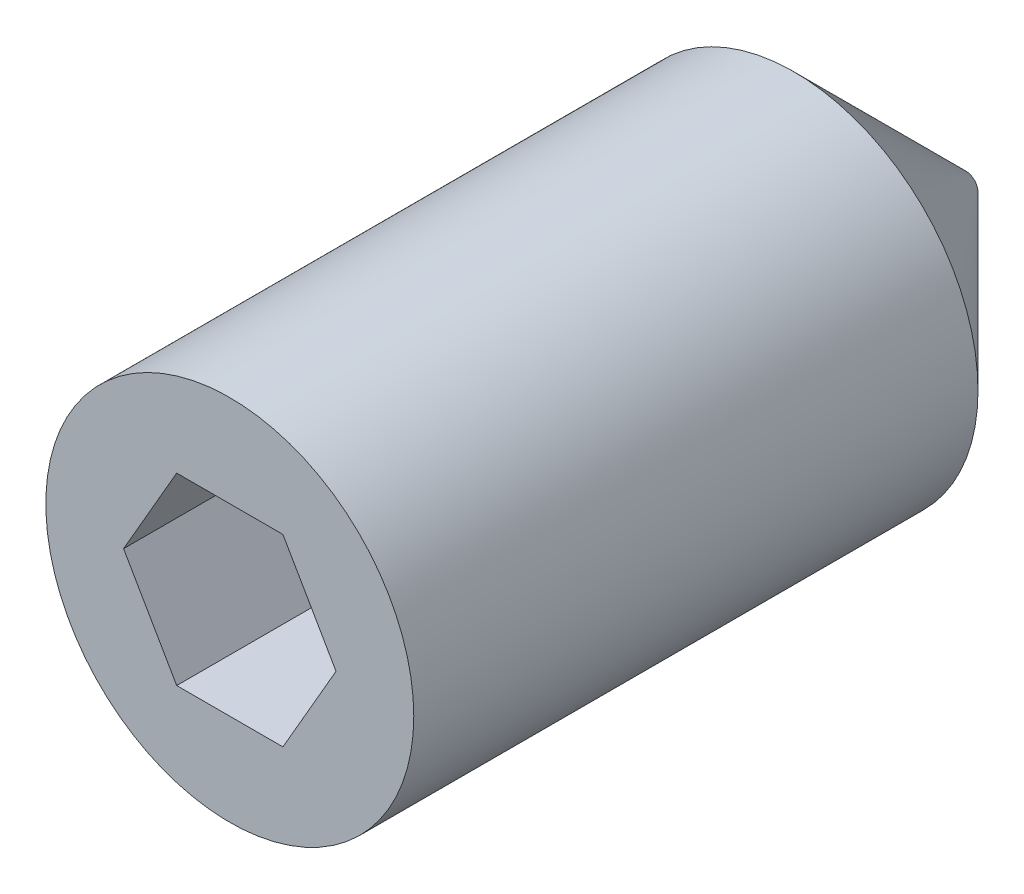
ISO-10303-21;
HEADER;
FILE_DESCRIPTION(('STEP AP214'),'2;1');
FILE_NAME('part.step','',(''),(''),'','','');
FILE_SCHEMA(('AUTOMOTIVE_DESIGN { 1 0 10303 214 1 1 1 1 }'));
ENDSEC;
DATA;
#1=APPLICATION_CONTEXT('core data for automotive mechanical design processes');
#2=APPLICATION_PROTOCOL_DEFINITION('international standard','automotive_design',2000,#1);
#3=PRODUCT_CONTEXT('',#1,'mechanical');
#4=PRODUCT('Part','Part','',(#3));
#5=PRODUCT_RELATED_PRODUCT_CATEGORY('part','',(#4));
#6=PRODUCT_DEFINITION_FORMATION('','',#4);
#7=PRODUCT_DEFINITION_CONTEXT('part definition',#1,'design');
#8=PRODUCT_DEFINITION('design','',#6,#7);
#9=PRODUCT_DEFINITION_SHAPE('','',#8);
#10=(LENGTH_UNIT() NAMED_UNIT(*) SI_UNIT(.MILLI.,.METRE.));
#11=(NAMED_UNIT(*) PLANE_ANGLE_UNIT() SI_UNIT($,.RADIAN.));
#12=(NAMED_UNIT(*) SI_UNIT($,.STERADIAN.) SOLID_ANGLE_UNIT());
#13=UNCERTAINTY_MEASURE_WITH_UNIT(LENGTH_MEASURE(1.E-05),#10,'distance_accuracy_value','');
#14=(GEOMETRIC_REPRESENTATION_CONTEXT(3) GLOBAL_UNCERTAINTY_ASSIGNED_CONTEXT((#13)) GLOBAL_UNIT_ASSIGNED_CONTEXT((#10,
#11,#12)) REPRESENTATION_CONTEXT('',''));
#15=CARTESIAN_POINT('',(0.,0.,0.));
#16=DIRECTION('',(0.,0.,1.));
#17=DIRECTION('',(1.,0.,0.));
#18=AXIS2_PLACEMENT_3D('',#15,#16,#17);
#19=CARTESIAN_POINT('',(0.,0.,-6.));
#20=DIRECTION('',(0.,0.,1.));
#21=DIRECTION('',(1.,0.,0.));
#22=AXIS2_PLACEMENT_3D('',#19,#20,#21);
#23=CYLINDRICAL_SURFACE('',#22,1.5);
#24=CARTESIAN_POINT('',(0.,0.,0.));
#25=DIRECTION('',(0.,0.,1.));
#26=DIRECTION('',(1.,0.,0.));
#27=AXIS2_PLACEMENT_3D('',#24,#25,#26);
#28=CIRCLE('',#27,1.5);
#29=CARTESIAN_POINT('',(1.5,0.,0.));
#30=VERTEX_POINT('',#29);
#31=EDGE_CURVE('E11',#30,#30,#28,.T.);
#32=ORIENTED_EDGE('',*,*,#31,.F.);
#33=EDGE_LOOP('',(#32));
#34=FACE_BOUND('',#33,.T.);
#35=CARTESIAN_POINT('',(0.,0.,-4.60000000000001));
#36=DIRECTION('',(0.,0.,1.));
#37=DIRECTION('',(1.,0.,0.));
#38=AXIS2_PLACEMENT_3D('',#35,#36,#37);
#39=CIRCLE('',#38,1.5);
#40=CARTESIAN_POINT('',(1.5,0.,-4.60000000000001));
#41=VERTEX_POINT('',#40);
#42=EDGE_CURVE('E125',#41,#41,#39,.T.);
#43=ORIENTED_EDGE('',*,*,#42,.T.);
#44=EDGE_LOOP('',(#43));
#45=FACE_BOUND('',#44,.T.);
#46=ADVANCED_FACE('F37',(#34,#45),#23,.T.);
#47=CARTESIAN_POINT('',(0.,0.,0.));
#48=DIRECTION('',(0.,0.,1.));
#49=DIRECTION('',(1.,0.,0.));
#50=AXIS2_PLACEMENT_3D('',#47,#48,#49);
#51=PLANE('',#50);
#52=DIRECTION('',(0.499999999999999,0.866025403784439,0.));
#53=VECTOR('',#52,1.);
#54=CARTESIAN_POINT('',(0.43301270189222,-0.75,0.));
#55=LINE('',#54,#53);
#56=CARTESIAN_POINT('',(0.43301270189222,-0.75,0.));
#57=VERTEX_POINT('',#56);
#58=CARTESIAN_POINT('',(0.866025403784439,0.,0.));
#59=VERTEX_POINT('',#58);
#60=EDGE_CURVE('E51',#57,#59,#55,.T.);
#61=ORIENTED_EDGE('',*,*,#60,.F.);
#62=DIRECTION('',(1.,0.,0.));
#63=VECTOR('',#62,1.);
#64=CARTESIAN_POINT('',(-0.433012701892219,-0.75,0.));
#65=LINE('',#64,#63);
#66=CARTESIAN_POINT('',(-0.433012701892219,-0.75,0.));
#67=VERTEX_POINT('',#66);
#68=EDGE_CURVE('E134',#67,#57,#65,.T.);
#69=ORIENTED_EDGE('',*,*,#68,.F.);
#70=DIRECTION('',(0.5,-0.866025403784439,0.));
#71=VECTOR('',#70,1.);
#72=CARTESIAN_POINT('',(-0.866025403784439,0.,0.));
#73=LINE('',#72,#71);
#74=CARTESIAN_POINT('',(-0.866025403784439,0.,0.));
#75=VERTEX_POINT('',#74);
#76=EDGE_CURVE('E132',#75,#67,#73,.T.);
#77=ORIENTED_EDGE('',*,*,#76,.F.);
#78=DIRECTION('',(-0.499999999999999,-0.866025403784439,0.));
#79=VECTOR('',#78,1.);
#80=CARTESIAN_POINT('',(-0.43301270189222,0.75,0.));
#81=LINE('',#80,#79);
#82=CARTESIAN_POINT('',(-0.43301270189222,0.75,0.));
#83=VERTEX_POINT('',#82);
#84=EDGE_CURVE('E98',#83,#75,#81,.T.);
#85=ORIENTED_EDGE('',*,*,#84,.F.);
#86=DIRECTION('',(-1.,0.,0.));
#87=VECTOR('',#86,1.);
#88=CARTESIAN_POINT('',(0.433012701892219,0.75,0.));
#89=LINE('',#88,#87);
#90=CARTESIAN_POINT('',(0.433012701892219,0.75,0.));
#91=VERTEX_POINT('',#90);
#92=EDGE_CURVE('E128',#91,#83,#89,.T.);
#93=ORIENTED_EDGE('',*,*,#92,.F.);
#94=DIRECTION('',(-0.5,0.866025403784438,0.));
#95=VECTOR('',#94,1.);
#96=CARTESIAN_POINT('',(0.866025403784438,0.,0.));
#97=LINE('',#96,#95);
#98=EDGE_CURVE('E124',#59,#91,#97,.T.);
#99=ORIENTED_EDGE('',*,*,#98,.F.);
#100=EDGE_LOOP('',(#61,#69,#77,#85,#93,#99));
#101=FACE_BOUND('',#100,.T.);
#102=ORIENTED_EDGE('',*,*,#31,.T.);
#103=EDGE_LOOP('',(#102));
#104=FACE_BOUND('',#103,.T.);
#105=ADVANCED_FACE('F146',(#101,#104),#51,.T.);
#106=CARTESIAN_POINT('',(0.43301270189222,-0.75,-1.2));
#107=DIRECTION('',(0.866025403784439,-0.499999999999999,0.));
#108=DIRECTION('',(0.5,0.866025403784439,0.));
#109=AXIS2_PLACEMENT_3D('',#106,#107,#108);
#110=PLANE('',#109);
#111=ORIENTED_EDGE('',*,*,#60,.T.);
#112=DIRECTION('',(0.,0.,1.));
#113=VECTOR('',#112,1.);
#114=CARTESIAN_POINT('',(0.866025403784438,0.,-1.2));
#115=LINE('',#114,#113);
#116=CARTESIAN_POINT('',(0.866025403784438,0.,-1.2));
#117=VERTEX_POINT('',#116);
#118=EDGE_CURVE('E80',#117,#59,#115,.T.);
#119=ORIENTED_EDGE('',*,*,#118,.F.);
#120=DIRECTION('',(0.499999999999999,0.866025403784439,0.));
#121=VECTOR('',#120,1.);
#122=CARTESIAN_POINT('',(0.43301270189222,-0.75,-1.2));
#123=LINE('',#122,#121);
#124=CARTESIAN_POINT('',(0.43301270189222,-0.75,-1.2));
#125=VERTEX_POINT('',#124);
#126=EDGE_CURVE('E136',#125,#117,#123,.T.);
#127=ORIENTED_EDGE('',*,*,#126,.F.);
#128=DIRECTION('',(0.,0.,1.));
#129=VECTOR('',#128,1.);
#130=CARTESIAN_POINT('',(0.43301270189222,-0.75,-1.2));
#131=LINE('',#130,#129);
#132=EDGE_CURVE('E44',#125,#57,#131,.T.);
#133=ORIENTED_EDGE('',*,*,#132,.T.);
#134=EDGE_LOOP('',(#111,#119,#127,#133));
#135=FACE_BOUND('',#134,.T.);
#136=ADVANCED_FACE('F175',(#135),#110,.F.);
#137=CARTESIAN_POINT('',(-0.433012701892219,-0.75,-1.2));
#138=DIRECTION('',(0.,-1.,0.));
#139=DIRECTION('',(1.,0.,0.));
#140=AXIS2_PLACEMENT_3D('',#137,#138,#139);
#141=PLANE('',#140);
#142=ORIENTED_EDGE('',*,*,#68,.T.);
#143=ORIENTED_EDGE('',*,*,#132,.F.);
#144=DIRECTION('',(1.,0.,0.));
#145=VECTOR('',#144,1.);
#146=CARTESIAN_POINT('',(-0.433012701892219,-0.75,-1.2));
#147=LINE('',#146,#145);
#148=CARTESIAN_POINT('',(-0.433012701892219,-0.75,-1.2));
#149=VERTEX_POINT('',#148);
#150=EDGE_CURVE('E110',#149,#125,#147,.T.);
#151=ORIENTED_EDGE('',*,*,#150,.F.);
#152=DIRECTION('',(0.,0.,1.));
#153=VECTOR('',#152,1.);
#154=CARTESIAN_POINT('',(-0.433012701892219,-0.75,-1.2));
#155=LINE('',#154,#153);
#156=EDGE_CURVE('E102',#149,#67,#155,.T.);
#157=ORIENTED_EDGE('',*,*,#156,.T.);
#158=EDGE_LOOP('',(#142,#143,#151,#157));
#159=FACE_BOUND('',#158,.T.);
#160=ADVANCED_FACE('F182',(#159),#141,.F.);
#161=CARTESIAN_POINT('',(-0.866025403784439,0.,-1.2));
#162=DIRECTION('',(-0.866025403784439,-0.5,0.));
#163=DIRECTION('',(0.5,-0.866025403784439,0.));
#164=AXIS2_PLACEMENT_3D('',#161,#162,#163);
#165=PLANE('',#164);
#166=ORIENTED_EDGE('',*,*,#76,.T.);
#167=ORIENTED_EDGE('',*,*,#156,.F.);
#168=DIRECTION('',(0.5,-0.866025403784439,0.));
#169=VECTOR('',#168,1.);
#170=CARTESIAN_POINT('',(-0.866025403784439,0.,-1.2));
#171=LINE('',#170,#169);
#172=CARTESIAN_POINT('',(-0.866025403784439,0.,-1.2));
#173=VERTEX_POINT('',#172);
#174=EDGE_CURVE('E106',#173,#149,#171,.T.);
#175=ORIENTED_EDGE('',*,*,#174,.F.);
#176=DIRECTION('',(0.,0.,1.));
#177=VECTOR('',#176,1.);
#178=CARTESIAN_POINT('',(-0.866025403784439,0.,-1.2));
#179=LINE('',#178,#177);
#180=EDGE_CURVE('E91',#173,#75,#179,.T.);
#181=ORIENTED_EDGE('',*,*,#180,.T.);
#182=EDGE_LOOP('',(#166,#167,#175,#181));
#183=FACE_BOUND('',#182,.T.);
#184=ADVANCED_FACE('F107',(#183),#165,.F.);
#185=CARTESIAN_POINT('',(-0.43301270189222,0.75,-1.2));
#186=DIRECTION('',(-0.866025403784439,0.5,0.));
#187=DIRECTION('',(-0.5,-0.866025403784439,0.));
#188=AXIS2_PLACEMENT_3D('',#185,#186,#187);
#189=PLANE('',#188);
#190=ORIENTED_EDGE('',*,*,#84,.T.);
#191=ORIENTED_EDGE('',*,*,#180,.F.);
#192=DIRECTION('',(-0.499999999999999,-0.866025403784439,0.));
#193=VECTOR('',#192,1.);
#194=CARTESIAN_POINT('',(-0.43301270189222,0.75,-1.2));
#195=LINE('',#194,#193);
#196=CARTESIAN_POINT('',(-0.43301270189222,0.75,-1.2));
#197=VERTEX_POINT('',#196);
#198=EDGE_CURVE('E95',#197,#173,#195,.T.);
#199=ORIENTED_EDGE('',*,*,#198,.F.);
#200=DIRECTION('',(0.,0.,1.));
#201=VECTOR('',#200,1.);
#202=CARTESIAN_POINT('',(-0.43301270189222,0.75,-1.2));
#203=LINE('',#202,#201);
#204=EDGE_CURVE('E103',#197,#83,#203,.T.);
#205=ORIENTED_EDGE('',*,*,#204,.T.);
#206=EDGE_LOOP('',(#190,#191,#199,#205));
#207=FACE_BOUND('',#206,.T.);
#208=ADVANCED_FACE('F93',(#207),#189,.F.);
#209=CARTESIAN_POINT('',(0.433012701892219,0.75,-1.2));
#210=DIRECTION('',(0.,1.,0.));
#211=DIRECTION('',(0.,0.,1.));
#212=AXIS2_PLACEMENT_3D('',#209,#210,#211);
#213=PLANE('',#212);
#214=ORIENTED_EDGE('',*,*,#92,.T.);
#215=ORIENTED_EDGE('',*,*,#204,.F.);
#216=DIRECTION('',(-1.,0.,0.));
#217=VECTOR('',#216,1.);
#218=CARTESIAN_POINT('',(0.433012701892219,0.75,-1.2));
#219=LINE('',#218,#217);
#220=CARTESIAN_POINT('',(0.433012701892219,0.75,-1.2));
#221=VERTEX_POINT('',#220);
#222=EDGE_CURVE('E116',#221,#197,#219,.T.);
#223=ORIENTED_EDGE('',*,*,#222,.F.);
#224=DIRECTION('',(0.,0.,1.));
#225=VECTOR('',#224,1.);
#226=CARTESIAN_POINT('',(0.433012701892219,0.75,-1.2));
#227=LINE('',#226,#225);
#228=EDGE_CURVE('E140',#221,#91,#227,.T.);
#229=ORIENTED_EDGE('',*,*,#228,.T.);
#230=EDGE_LOOP('',(#214,#215,#223,#229));
#231=FACE_BOUND('',#230,.T.);
#232=ADVANCED_FACE('F150',(#231),#213,.F.);
#233=CARTESIAN_POINT('',(0.866025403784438,0.,-1.2));
#234=DIRECTION('',(0.866025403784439,0.5,0.));
#235=DIRECTION('',(-0.5,0.866025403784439,0.));
#236=AXIS2_PLACEMENT_3D('',#233,#234,#235);
#237=PLANE('',#236);
#238=ORIENTED_EDGE('',*,*,#98,.T.);
#239=ORIENTED_EDGE('',*,*,#228,.F.);
#240=DIRECTION('',(-0.5,0.866025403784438,0.));
#241=VECTOR('',#240,1.);
#242=CARTESIAN_POINT('',(0.866025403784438,0.,-1.2));
#243=LINE('',#242,#241);
#244=EDGE_CURVE('E118',#117,#221,#243,.T.);
#245=ORIENTED_EDGE('',*,*,#244,.F.);
#246=ORIENTED_EDGE('',*,*,#118,.T.);
#247=EDGE_LOOP('',(#238,#239,#245,#246));
#248=FACE_BOUND('',#247,.T.);
#249=ADVANCED_FACE('F143',(#248),#237,.F.);
#250=CARTESIAN_POINT('',(0.,0.,-1.2));
#251=DIRECTION('',(0.,0.,1.));
#252=DIRECTION('',(1.,0.,0.));
#253=AXIS2_PLACEMENT_3D('',#250,#251,#252);
#254=PLANE('',#253);
#255=ORIENTED_EDGE('',*,*,#126,.T.);
#256=ORIENTED_EDGE('',*,*,#244,.T.);
#257=ORIENTED_EDGE('',*,*,#222,.T.);
#258=ORIENTED_EDGE('',*,*,#198,.T.);
#259=ORIENTED_EDGE('',*,*,#174,.T.);
#260=ORIENTED_EDGE('',*,*,#150,.T.);
#261=EDGE_LOOP('',(#255,#256,#257,#258,#259,#260));
#262=FACE_BOUND('',#261,.T.);
#263=ADVANCED_FACE('F113',(#262),#254,.T.);
#264=CARTESIAN_POINT('',(0.,0.,-4.60000000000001));
#265=DIRECTION('',(0.,0.,1.));
#266=DIRECTION('',(1.,0.,0.));
#267=AXIS2_PLACEMENT_3D('',#264,#265,#266);
#268=CONICAL_SURFACE('',#267,1.5,0.785398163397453);
#269=CARTESIAN_POINT('',(0.,0.,-6.));
#270=DIRECTION('',(0.,0.,1.));
#271=DIRECTION('',(1.,0.,0.));
#272=AXIS2_PLACEMENT_3D('',#269,#270,#271);
#273=CIRCLE('',#272,0.1);
#274=CARTESIAN_POINT('',(0.0999999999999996,0.,-6.));
#275=VERTEX_POINT('',#274);
#276=EDGE_CURVE('E155',#275,#275,#273,.T.);
#277=CARTESIAN_POINT('',(0.0999999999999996,0.,-6.));
#278=CARTESIAN_POINT('',(0.114583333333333,0.,-5.98541666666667));
#279=CARTESIAN_POINT('',(0.129166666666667,0.,-5.97083333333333));
#280=CARTESIAN_POINT('',(0.158333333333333,0.,-5.94166666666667));
#281=CARTESIAN_POINT('',(0.172916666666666,0.,-5.92708333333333));
#282=CARTESIAN_POINT('',(0.202083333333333,0.,-5.89791666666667));
#283=CARTESIAN_POINT('',(0.216666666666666,0.,-5.88333333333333));
#284=CARTESIAN_POINT('',(0.245833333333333,0.,-5.85416666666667));
#285=CARTESIAN_POINT('',(0.260416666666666,0.,-5.83958333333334));
#286=CARTESIAN_POINT('',(0.289583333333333,0.,-5.81041666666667));
#287=CARTESIAN_POINT('',(0.304166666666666,0.,-5.79583333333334));
#288=CARTESIAN_POINT('',(0.333333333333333,0.,-5.76666666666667));
#289=CARTESIAN_POINT('',(0.347916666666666,0.,-5.75208333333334));
#290=CARTESIAN_POINT('',(0.377083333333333,0.,-5.72291666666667));
#291=CARTESIAN_POINT('',(0.391666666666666,0.,-5.70833333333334));
#292=CARTESIAN_POINT('',(0.420833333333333,0.,-5.67916666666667));
#293=CARTESIAN_POINT('',(0.435416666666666,0.,-5.66458333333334));
#294=CARTESIAN_POINT('',(0.464583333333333,0.,-5.63541666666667));
#295=CARTESIAN_POINT('',(0.479166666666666,0.,-5.62083333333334));
#296=CARTESIAN_POINT('',(0.508333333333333,0.,-5.59166666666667));
#297=CARTESIAN_POINT('',(0.522916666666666,0.,-5.57708333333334));
#298=CARTESIAN_POINT('',(0.552083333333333,0.,-5.54791666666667));
#299=CARTESIAN_POINT('',(0.566666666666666,0.,-5.53333333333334));
#300=CARTESIAN_POINT('',(0.595833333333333,0.,-5.50416666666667));
#301=CARTESIAN_POINT('',(0.610416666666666,0.,-5.48958333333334));
#302=CARTESIAN_POINT('',(0.639583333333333,0.,-5.46041666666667));
#303=CARTESIAN_POINT('',(0.654166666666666,0.,-5.44583333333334));
#304=CARTESIAN_POINT('',(0.683333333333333,0.,-5.41666666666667));
#305=CARTESIAN_POINT('',(0.697916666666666,0.,-5.40208333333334));
#306=CARTESIAN_POINT('',(0.727083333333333,0.,-5.37291666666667));
#307=CARTESIAN_POINT('',(0.741666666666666,0.,-5.35833333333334));
#308=CARTESIAN_POINT('',(0.770833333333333,0.,-5.32916666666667));
#309=CARTESIAN_POINT('',(0.785416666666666,0.,-5.31458333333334));
#310=CARTESIAN_POINT('',(0.814583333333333,0.,-5.28541666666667));
#311=CARTESIAN_POINT('',(0.829166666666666,0.,-5.27083333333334));
#312=CARTESIAN_POINT('',(0.858333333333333,0.,-5.24166666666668));
#313=CARTESIAN_POINT('',(0.872916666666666,0.,-5.22708333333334));
#314=CARTESIAN_POINT('',(0.902083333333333,0.,-5.19791666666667));
#315=CARTESIAN_POINT('',(0.916666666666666,0.,-5.18333333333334));
#316=CARTESIAN_POINT('',(0.945833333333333,0.,-5.15416666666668));
#317=CARTESIAN_POINT('',(0.960416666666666,0.,-5.13958333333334));
#318=CARTESIAN_POINT('',(0.989583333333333,0.,-5.11041666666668));
#319=CARTESIAN_POINT('',(1.00416666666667,0.,-5.09583333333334));
#320=CARTESIAN_POINT('',(1.03333333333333,0.,-5.06666666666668));
#321=CARTESIAN_POINT('',(1.04791666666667,0.,-5.05208333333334));
#322=CARTESIAN_POINT('',(1.07708333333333,0.,-5.02291666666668));
#323=CARTESIAN_POINT('',(1.09166666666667,0.,-5.00833333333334));
#324=CARTESIAN_POINT('',(1.12083333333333,0.,-4.97916666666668));
#325=CARTESIAN_POINT('',(1.13541666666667,0.,-4.96458333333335));
#326=CARTESIAN_POINT('',(1.16458333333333,0.,-4.93541666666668));
#327=CARTESIAN_POINT('',(1.17916666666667,0.,-4.92083333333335));
#328=CARTESIAN_POINT('',(1.20833333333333,0.,-4.89166666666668));
#329=CARTESIAN_POINT('',(1.22291666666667,0.,-4.87708333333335));
#330=CARTESIAN_POINT('',(1.25208333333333,0.,-4.84791666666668));
#331=CARTESIAN_POINT('',(1.26666666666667,0.,-4.83333333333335));
#332=CARTESIAN_POINT('',(1.29583333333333,0.,-4.80416666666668));
#333=CARTESIAN_POINT('',(1.31041666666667,0.,-4.78958333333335));
#334=CARTESIAN_POINT('',(1.33958333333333,0.,-4.76041666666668));
#335=CARTESIAN_POINT('',(1.35416666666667,0.,-4.74583333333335));
#336=CARTESIAN_POINT('',(1.38333333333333,0.,-4.71666666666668));
#337=CARTESIAN_POINT('',(1.39791666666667,0.,-4.70208333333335));
#338=CARTESIAN_POINT('',(1.42708333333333,0.,-4.67291666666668));
#339=CARTESIAN_POINT('',(1.44166666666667,0.,-4.65833333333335));
#340=CARTESIAN_POINT('',(1.47083333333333,0.,-4.62916666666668));
#341=CARTESIAN_POINT('',(1.48541666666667,0.,-4.61458333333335));
#342=CARTESIAN_POINT('',(1.5,0.,-4.60000000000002));
#343=B_SPLINE_CURVE_WITH_KNOTS('',3,(#277,#278,#279,#280,#281,#282,#283,#284,#285,#286,#287,
#288,#289,#290,#291,#292,#293,#294,#295,#296,#297,#298,#299,#300,#301,#302,#303,#304,#305,#306,
#307,#308,#309,#310,#311,#312,#313,#314,#315,#316,#317,#318,#319,#320,#321,#322,#323,#324,#325,
#326,#327,#328,#329,#330,#331,#332,#333,#334,#335,#336,#337,#338,#339,#340,#341,#342),
.UNSPECIFIED.,.F.,.F.,(4,2,2,2,2,2,2,2,2,2,2,2,2,2,2,2,2,2,2,2,2,2,2,2,2,2,2,2,2,2,2,2,4),(0.,
0.0618718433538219,0.123743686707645,0.185615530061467,0.24748737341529,0.309359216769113,
0.371231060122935,0.433102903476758,0.49497474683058,0.556846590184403,0.618718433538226,
0.680590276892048,0.742462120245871,0.804333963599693,0.866205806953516,0.928077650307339,
0.989949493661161,1.05182133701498,1.11369318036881,1.17556502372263,1.23743686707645,
1.29930871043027,1.3611805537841,1.42305239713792,1.48492424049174,1.54679608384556,
1.60866792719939,1.67053977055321,1.73241161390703,1.79428345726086,1.85615530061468,
1.9180271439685,1.97989898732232),.UNSPECIFIED.);
#344=EDGE_CURVE('BSEAM159',#275,#41,#343,.T.);
#345=ORIENTED_EDGE('',*,*,#276,.T.);
#346=ORIENTED_EDGE('',*,*,#42,.F.);
#347=ORIENTED_EDGE('',*,*,#344,.T.);
#348=ORIENTED_EDGE('',*,*,#344,.F.);
#349=EDGE_LOOP('',(#345,#347,#346,#348));
#350=FACE_BOUND('',#349,.T.);
#351=ADVANCED_FACE('F159',(#350),#268,.T.);
#352=CARTESIAN_POINT('',(0.,0.,-6.));
#353=DIRECTION('',(0.,0.,1.));
#354=DIRECTION('',(1.,0.,0.));
#355=AXIS2_PLACEMENT_3D('',#352,#353,#354);
#356=PLANE('',#355);
#357=ORIENTED_EDGE('',*,*,#276,.F.);
#358=EDGE_LOOP('',(#357));
#359=FACE_BOUND('',#358,.T.);
#360=ADVANCED_FACE('F162',(#359),#356,.F.);
#361=CLOSED_SHELL('',(#46,#105,#136,#160,#184,#208,#232,#249,#263,#351,#360));
#362=MANIFOLD_SOLID_BREP('B2',#361);
#363=ADVANCED_BREP_SHAPE_REPRESENTATION('',(#18,#362),#14);
#364=SHAPE_DEFINITION_REPRESENTATION(#9,#363);
ENDSEC;
END-ISO-10303-21;
